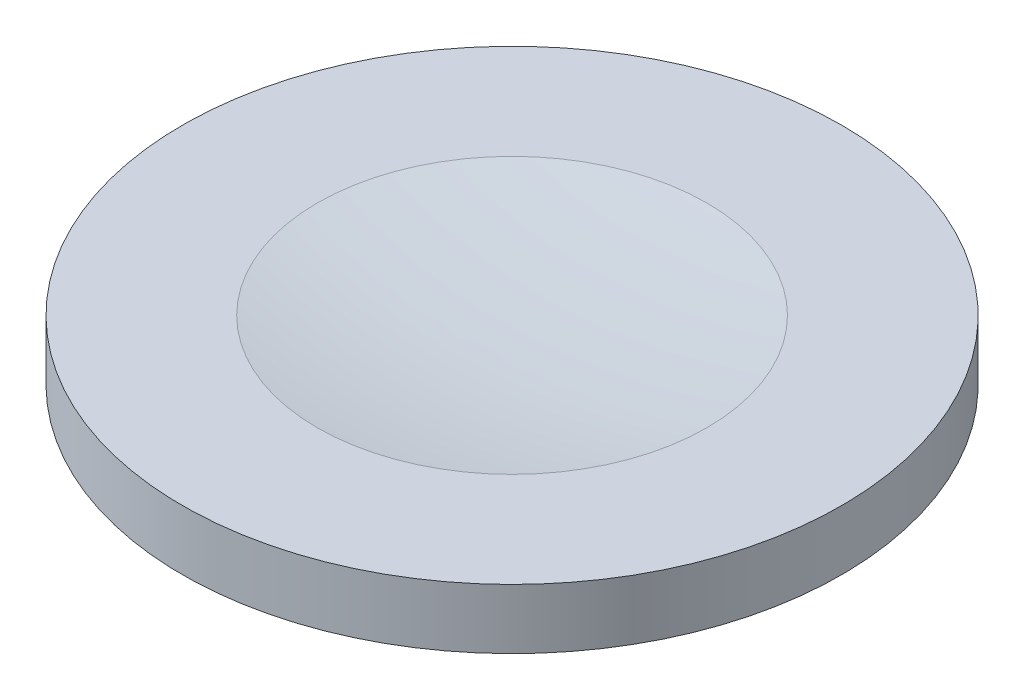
ISO-10303-21;
HEADER;
FILE_DESCRIPTION(('STEP AP214'),'2;1');
FILE_NAME('part.step','',(''),(''),'','','');
FILE_SCHEMA(('AUTOMOTIVE_DESIGN { 1 0 10303 214 1 1 1 1 }'));
ENDSEC;
DATA;
#1=APPLICATION_CONTEXT('core data for automotive mechanical design processes');
#2=APPLICATION_PROTOCOL_DEFINITION('international standard','automotive_design',2000,#1);
#3=PRODUCT_CONTEXT('',#1,'mechanical');
#4=PRODUCT('Part','Part','',(#3));
#5=PRODUCT_RELATED_PRODUCT_CATEGORY('part','',(#4));
#6=PRODUCT_DEFINITION_FORMATION('','',#4);
#7=PRODUCT_DEFINITION_CONTEXT('part definition',#1,'design');
#8=PRODUCT_DEFINITION('design','',#6,#7);
#9=PRODUCT_DEFINITION_SHAPE('','',#8);
#10=(LENGTH_UNIT() NAMED_UNIT(*) SI_UNIT(.MILLI.,.METRE.));
#11=(NAMED_UNIT(*) PLANE_ANGLE_UNIT() SI_UNIT($,.RADIAN.));
#12=(NAMED_UNIT(*) SI_UNIT($,.STERADIAN.) SOLID_ANGLE_UNIT());
#13=UNCERTAINTY_MEASURE_WITH_UNIT(LENGTH_MEASURE(1.E-05),#10,'distance_accuracy_value','');
#14=(GEOMETRIC_REPRESENTATION_CONTEXT(3) GLOBAL_UNCERTAINTY_ASSIGNED_CONTEXT((#13)) GLOBAL_UNIT_ASSIGNED_CONTEXT((#10,
#11,#12)) REPRESENTATION_CONTEXT('',''));
#15=CARTESIAN_POINT('',(0.,0.,0.));
#16=DIRECTION('',(0.,0.,1.));
#17=DIRECTION('',(1.,0.,0.));
#18=AXIS2_PLACEMENT_3D('',#15,#16,#17);
#19=CARTESIAN_POINT('',(0.,5.5,0.));
#20=DIRECTION('',(0.,-1.,0.));
#21=DIRECTION('',(0.,0.,-1.));
#22=AXIS2_PLACEMENT_3D('',#19,#20,#21);
#23=CYLINDRICAL_SURFACE('',#22,11.);
#24=CARTESIAN_POINT('',(0.,3.5,0.));
#25=DIRECTION('',(0.,-1.,0.));
#26=DIRECTION('',(0.,0.,-1.));
#27=AXIS2_PLACEMENT_3D('',#24,#25,#26);
#28=CIRCLE('',#27,11.);
#29=CARTESIAN_POINT('',(0.,3.5,-11.));
#30=VERTEX_POINT('',#29);
#31=EDGE_CURVE('E10',#30,#30,#28,.T.);
#32=ORIENTED_EDGE('',*,*,#31,.F.);
#33=EDGE_LOOP('',(#32));
#34=FACE_BOUND('',#33,.T.);
#35=CARTESIAN_POINT('',(0.,5.5,0.));
#36=DIRECTION('',(0.,-1.,0.));
#37=DIRECTION('',(0.,0.,-1.));
#38=AXIS2_PLACEMENT_3D('',#35,#36,#37);
#39=CIRCLE('',#38,11.);
#40=CARTESIAN_POINT('',(0.,5.5,-11.));
#41=VERTEX_POINT('',#40);
#42=EDGE_CURVE('E61',#41,#41,#39,.T.);
#43=ORIENTED_EDGE('',*,*,#42,.T.);
#44=EDGE_LOOP('',(#43));
#45=FACE_BOUND('',#44,.T.);
#46=ADVANCED_FACE('F30',(#34,#45),#23,.T.);
#47=CARTESIAN_POINT('',(-11.,3.5,0.));
#48=DIRECTION('',(0.,1.,0.));
#49=DIRECTION('',(0.,0.,1.));
#50=AXIS2_PLACEMENT_3D('',#47,#48,#49);
#51=PLANE('',#50);
#52=CARTESIAN_POINT('',(0.,3.5,0.));
#53=DIRECTION('',(0.,-1.,0.));
#54=DIRECTION('',(0.,0.,-1.));
#55=AXIS2_PLACEMENT_3D('',#52,#53,#54);
#56=CIRCLE('',#55,5.5);
#57=CARTESIAN_POINT('',(0.,3.5,-5.5));
#58=VERTEX_POINT('',#57);
#59=EDGE_CURVE('E36',#58,#58,#56,.T.);
#60=ORIENTED_EDGE('',*,*,#59,.F.);
#61=EDGE_LOOP('',(#60));
#62=FACE_BOUND('',#61,.T.);
#63=ORIENTED_EDGE('',*,*,#31,.T.);
#64=EDGE_LOOP('',(#63));
#65=FACE_BOUND('',#64,.T.);
#66=ADVANCED_FACE('F83',(#62,#65),#51,.F.);
#67=CARTESIAN_POINT('',(0.,5.5,0.));
#68=DIRECTION('',(0.,-1.,0.));
#69=DIRECTION('',(0.,0.,-1.));
#70=AXIS2_PLACEMENT_3D('',#67,#68,#69);
#71=CYLINDRICAL_SURFACE('',#70,5.5);
#72=CARTESIAN_POINT('',(0.,3.,0.));
#73=DIRECTION('',(0.,-1.,0.));
#74=DIRECTION('',(0.,0.,-1.));
#75=AXIS2_PLACEMENT_3D('',#72,#73,#74);
#76=CIRCLE('',#75,5.5);
#77=CARTESIAN_POINT('',(0.,3.,-5.5));
#78=VERTEX_POINT('',#77);
#79=EDGE_CURVE('E40',#78,#78,#76,.T.);
#80=ORIENTED_EDGE('',*,*,#79,.F.);
#81=EDGE_LOOP('',(#80));
#82=FACE_BOUND('',#81,.T.);
#83=ORIENTED_EDGE('',*,*,#59,.T.);
#84=EDGE_LOOP('',(#83));
#85=FACE_BOUND('',#84,.T.);
#86=ADVANCED_FACE('F88',(#82,#85),#71,.T.);
#87=CARTESIAN_POINT('',(-5.5,3.,0.));
#88=DIRECTION('',(0.,1.,0.));
#89=DIRECTION('',(0.,0.,1.));
#90=AXIS2_PLACEMENT_3D('',#87,#88,#89);
#91=PLANE('',#90);
#92=CARTESIAN_POINT('',(0.,3.,0.));
#93=DIRECTION('',(0.,-1.,0.));
#94=DIRECTION('',(0.,0.,-1.));
#95=AXIS2_PLACEMENT_3D('',#92,#93,#94);
#96=CIRCLE('',#95,4.);
#97=CARTESIAN_POINT('',(0.,3.,-4.));
#98=VERTEX_POINT('',#97);
#99=EDGE_CURVE('E44',#98,#98,#96,.T.);
#100=ORIENTED_EDGE('',*,*,#99,.F.);
#101=EDGE_LOOP('',(#100));
#102=FACE_BOUND('',#101,.T.);
#103=ORIENTED_EDGE('',*,*,#79,.T.);
#104=EDGE_LOOP('',(#103));
#105=FACE_BOUND('',#104,.T.);
#106=ADVANCED_FACE('F93',(#102,#105),#91,.F.);
#107=CARTESIAN_POINT('',(0.,5.5,0.));
#108=DIRECTION('',(0.,-1.,0.));
#109=DIRECTION('',(0.,0.,-1.));
#110=AXIS2_PLACEMENT_3D('',#107,#108,#109);
#111=CYLINDRICAL_SURFACE('',#110,4.);
#112=CARTESIAN_POINT('',(0.,0.,0.));
#113=DIRECTION('',(0.,-1.,0.));
#114=DIRECTION('',(0.,0.,-1.));
#115=AXIS2_PLACEMENT_3D('',#112,#113,#114);
#116=CIRCLE('',#115,4.);
#117=CARTESIAN_POINT('',(0.,0.,-4.));
#118=VERTEX_POINT('',#117);
#119=EDGE_CURVE('E49',#118,#118,#116,.T.);
#120=ORIENTED_EDGE('',*,*,#119,.F.);
#121=EDGE_LOOP('',(#120));
#122=FACE_BOUND('',#121,.T.);
#123=ORIENTED_EDGE('',*,*,#99,.T.);
#124=EDGE_LOOP('',(#123));
#125=FACE_BOUND('',#124,.T.);
#126=ADVANCED_FACE('F99',(#122,#125),#111,.T.);
#127=CARTESIAN_POINT('',(-4.,0.,0.));
#128=DIRECTION('',(0.,1.,0.));
#129=DIRECTION('',(0.,0.,1.));
#130=AXIS2_PLACEMENT_3D('',#127,#128,#129);
#131=PLANE('',#130);
#132=CARTESIAN_POINT('',(0.,0.,0.));
#133=DIRECTION('',(0.,-1.,0.));
#134=DIRECTION('',(0.,0.,-1.));
#135=AXIS2_PLACEMENT_3D('',#132,#133,#134);
#136=CIRCLE('',#135,3.);
#137=CARTESIAN_POINT('',(0.,0.,-3.));
#138=VERTEX_POINT('',#137);
#139=EDGE_CURVE('E52',#138,#138,#136,.T.);
#140=ORIENTED_EDGE('',*,*,#139,.F.);
#141=EDGE_LOOP('',(#140));
#142=FACE_BOUND('',#141,.T.);
#143=ORIENTED_EDGE('',*,*,#119,.T.);
#144=EDGE_LOOP('',(#143));
#145=FACE_BOUND('',#144,.T.);
#146=ADVANCED_FACE('F103',(#142,#145),#131,.F.);
#147=CARTESIAN_POINT('',(0.,5.5,0.));
#148=DIRECTION('',(0.,-1.,0.));
#149=DIRECTION('',(0.,0.,-1.));
#150=AXIS2_PLACEMENT_3D('',#147,#148,#149);
#151=CYLINDRICAL_SURFACE('',#150,3.);
#152=CARTESIAN_POINT('',(0.,3.,0.));
#153=DIRECTION('',(0.,-1.,0.));
#154=DIRECTION('',(0.,0.,-1.));
#155=AXIS2_PLACEMENT_3D('',#152,#153,#154);
#156=CIRCLE('',#155,3.);
#157=CARTESIAN_POINT('',(0.,3.,-3.));
#158=VERTEX_POINT('',#157);
#159=EDGE_CURVE('E55',#158,#158,#156,.T.);
#160=ORIENTED_EDGE('',*,*,#159,.F.);
#161=EDGE_LOOP('',(#160));
#162=FACE_BOUND('',#161,.T.);
#163=ORIENTED_EDGE('',*,*,#139,.T.);
#164=EDGE_LOOP('',(#163));
#165=FACE_BOUND('',#164,.T.);
#166=ADVANCED_FACE('F79',(#162,#165),#151,.F.);
#167=CARTESIAN_POINT('',(-3.,3.,0.));
#168=DIRECTION('',(0.,1.,0.));
#169=DIRECTION('',(0.,0.,1.));
#170=AXIS2_PLACEMENT_3D('',#167,#168,#169);
#171=PLANE('',#170);
#172=ORIENTED_EDGE('',*,*,#159,.T.);
#173=EDGE_LOOP('',(#172));
#174=FACE_BOUND('',#173,.T.);
#175=ADVANCED_FACE('F74',(#174),#171,.F.);
#176=CARTESIAN_POINT('',(0.,47.5000000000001,0.));
#177=DIRECTION('',(0.,-1.,0.));
#178=DIRECTION('',(-1.,0.,0.));
#179=AXIS2_PLACEMENT_3D('',#176,#177,#178);
#180=SPHERICAL_SURFACE('',#179,42.5000000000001);
#181=CARTESIAN_POINT('',(0.,5.5,0.));
#182=DIRECTION('',(0.,-1.,0.));
#183=DIRECTION('',(0.,0.,-1.));
#184=AXIS2_PLACEMENT_3D('',#181,#182,#183);
#185=CIRCLE('',#184,6.5);
#186=CARTESIAN_POINT('',(0.,5.5,-6.5));
#187=VERTEX_POINT('',#186);
#188=EDGE_CURVE('E58',#187,#187,#185,.T.);
#189=ORIENTED_EDGE('',*,*,#188,.F.);
#190=EDGE_LOOP('',(#189));
#191=FACE_BOUND('',#190,.T.);
#192=ADVANCED_FACE('F69',(#191),#180,.F.);
#193=CARTESIAN_POINT('',(-6.5,5.5,0.));
#194=DIRECTION('',(0.,-1.,0.));
#195=DIRECTION('',(0.,0.,-1.));
#196=AXIS2_PLACEMENT_3D('',#193,#194,#195);
#197=PLANE('',#196);
#198=ORIENTED_EDGE('',*,*,#42,.F.);
#199=EDGE_LOOP('',(#198));
#200=FACE_BOUND('',#199,.T.);
#201=ORIENTED_EDGE('',*,*,#188,.T.);
#202=EDGE_LOOP('',(#201));
#203=FACE_BOUND('',#202,.T.);
#204=ADVANCED_FACE('F66',(#200,#203),#197,.F.);
#205=CLOSED_SHELL('',(#46,#66,#86,#106,#126,#146,#166,#175,#192,#204));
#206=MANIFOLD_SOLID_BREP('B2',#205);
#207=ADVANCED_BREP_SHAPE_REPRESENTATION('',(#18,#206),#14);
#208=SHAPE_DEFINITION_REPRESENTATION(#9,#207);
ENDSEC;
END-ISO-10303-21;
